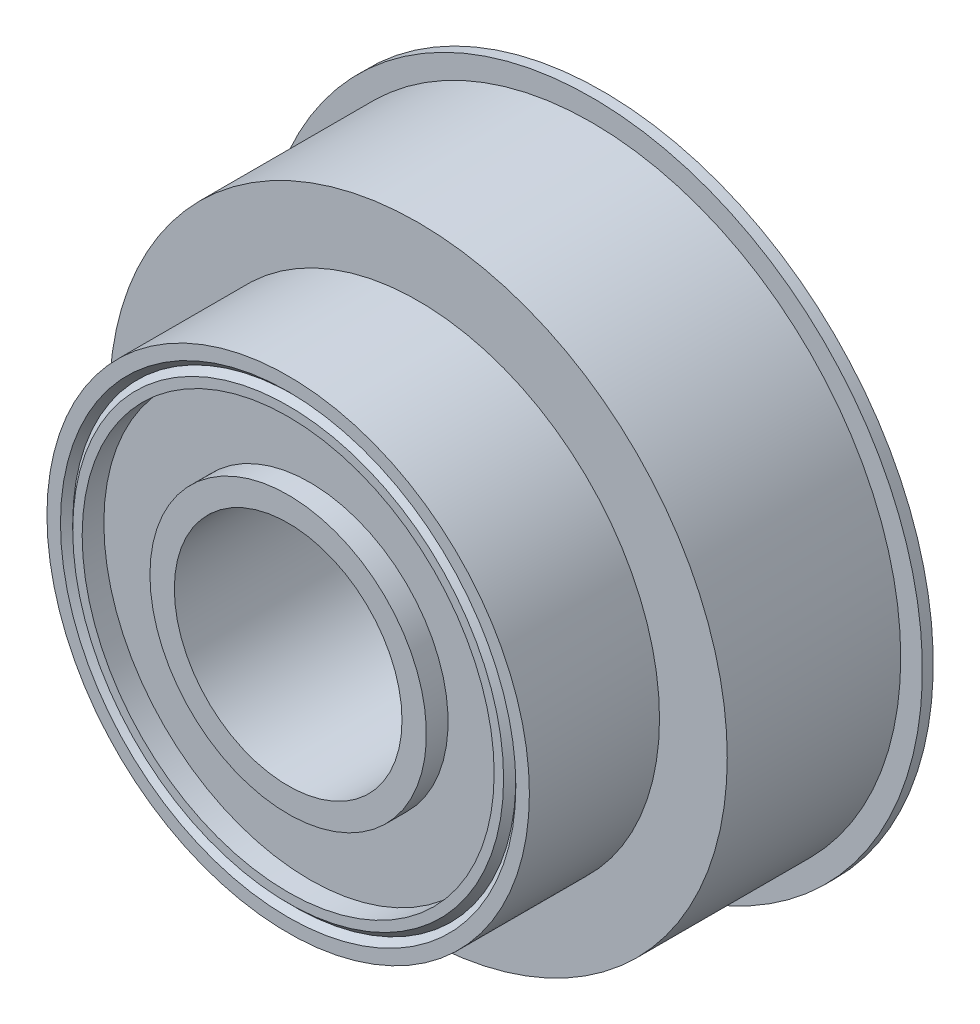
from build123d import *


with BuildPart() as part:
    # Sketch1 → Revolve1 (revolve)
    with BuildSketch(Plane(origin=(0, 0, 0), x_dir=(0, 0, -1), z_dir=(1, 0, 0)), mode=Mode.PRIVATE) as revolve1_sk:
        Polygon((0, 10.5), (0, 12.75), (2, 12.75), (2, 19), (0, 19), (0, 19.869937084), (0.565031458, 20.434968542), (0, 21), (0, 22.25), (12, 22.25), (12, 28.5), (28, 28.5), (28, 30.5), (29, 30.5), (29, 26.5), (28.5, 26.5), (28.5, 17.5), (22.270657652, 17.5), (19.770657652, 15), (19.770657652, 10.5), align=None)
    revolve(revolve1_sk.sketch.rotate(Axis((0, 0, -80.9), (0, 0, 1)), 90), axis=Axis((0, 0, -80.9), (0, 0, 1)))


solid = part.part
